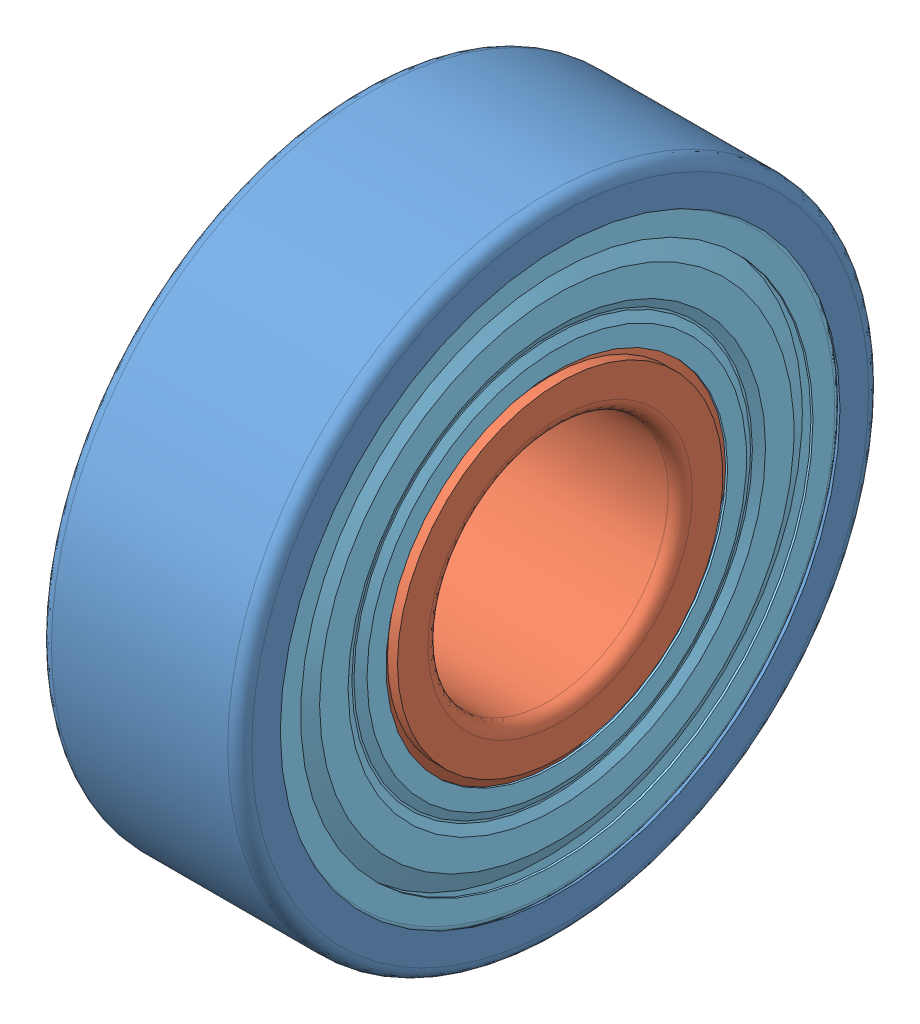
SolidWorks assembly 6201 ZZ.SLDASM, configuration Default (file format 6000). Lengths in mm.
Overall size (10 32 32).
5 component instances, 5 part files, 0 mates.
Components (placement in the parent):
- 6201zz_01-1: 6201zz_01.SLDPRT [Default] at origin size (10 32 32)
- 6201zz_02-1: 6201zz_02.SLDPRT [Default] at origin size (10 20.2 20.2)
- 6201zz_03-1: 6201zz_03.SLDPRT [Default] at origin size (6 28 28)
- 6201zz_04-1: 6201zz_04.SLDPRT [Default] at origin size (0.67 28.42 28.42)
- 6201zz_05-1: 6201zz_05.SLDPRT [Default] at origin size (0.67 28.42 28.42)
